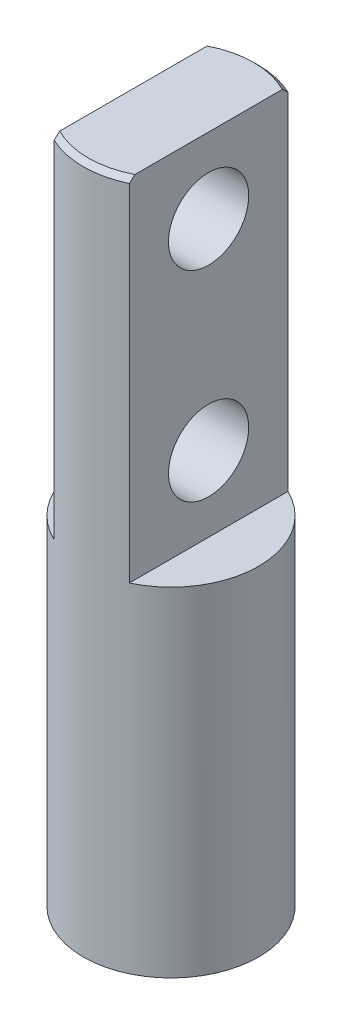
from build123d import *

# Parameters (mm, degrees)
SKETCH1_R           = 3.5
BOSS_EXTRUDE1_DEPTH = 13.5
BOSS_EXTRUDE2_START = 14
BOSS_EXTRUDE2_DEPTH = 14
SKETCH3_R           = 1.6
CUT_EXTRUDE1_DEPTH  = 3
CHAMFER1_SIZE       = 0.2


with BuildPart() as part:
    # Sketch1 → Boss-Extrude1 (new body)
    with BuildSketch(Plane(origin=(0, 0, 0), x_dir=(1, 0, 0), z_dir=(0, 1, 0))):
        with Locations(Location((0, 0, 0), (0, 0, 270))):
            Circle(SKETCH1_R)
    extrude(amount=-BOSS_EXTRUDE1_DEPTH)

    # Sketch2 → Boss-Extrude2 (add)
    with BuildSketch(Plane(origin=(0, 0, 0), x_dir=(1, 0, 0), z_dir=(0, 1, 0)).offset(BOSS_EXTRUDE2_START)):
        with BuildLine():
            Line((1.5, -3.16227766), (1.5, 3.16227766))
            ThreePointArc((1.5, 3.16227766), (0, 3.5), (-1.5, 3.16227766))
            Line((-1.5, 3.16227766), (-1.5, -3.16227766))
            ThreePointArc((-1.5, -3.16227766), (0, -3.5), (1.5, -3.16227766))
        make_face()
    extrude(amount=-BOSS_EXTRUDE2_DEPTH)

    # Sketch3 → Cut-Extrude1 (cut)
    with BuildSketch(Plane(origin=(1.5, 0, 0), x_dir=(0, 0, -1), z_dir=(1, 0, 0))):
        with Locations((0, 11)):
            Circle(SKETCH3_R)
        with Locations((0, 3)):
            Circle(SKETCH3_R)
    extrude(amount=-CUT_EXTRUDE1_DEPTH, mode=Mode.SUBTRACT)

    # Chamfer1
    chamfer1_edges = [part.edges().sort_by_distance(p)[0] for p in [
        (0, 14, 3.5),
        (0, 14, -3.5),
    ]]
    chamfer(chamfer1_edges, length=CHAMFER1_SIZE)


solid = part.part
